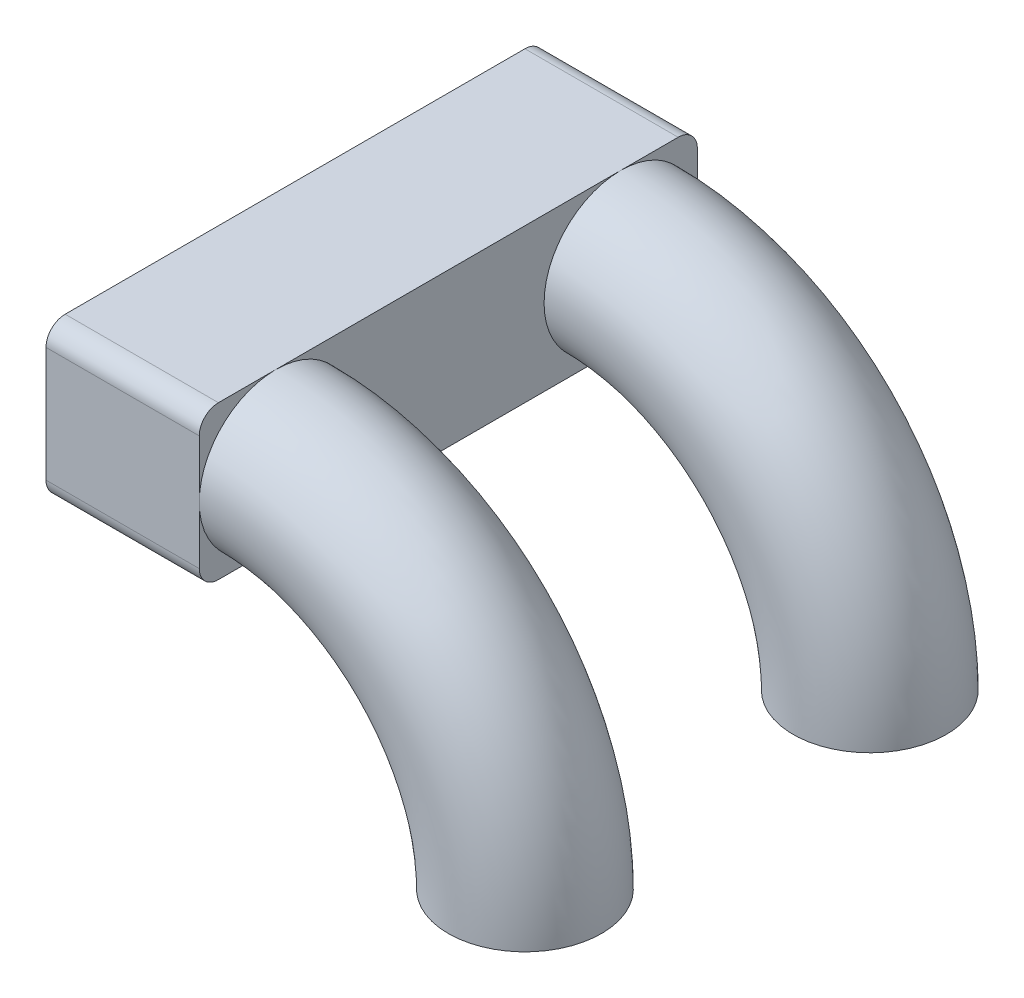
ISO-10303-21;
HEADER;
FILE_DESCRIPTION(('STEP AP214'),'2;1');
FILE_NAME('part.step','',(''),(''),'','','');
FILE_SCHEMA(('AUTOMOTIVE_DESIGN { 1 0 10303 214 1 1 1 1 }'));
ENDSEC;
DATA;
#1=APPLICATION_CONTEXT('core data for automotive mechanical design processes');
#2=APPLICATION_PROTOCOL_DEFINITION('international standard','automotive_design',2000,#1);
#3=PRODUCT_CONTEXT('',#1,'mechanical');
#4=PRODUCT('Part','Part','',(#3));
#5=PRODUCT_RELATED_PRODUCT_CATEGORY('part','',(#4));
#6=PRODUCT_DEFINITION_FORMATION('','',#4);
#7=PRODUCT_DEFINITION_CONTEXT('part definition',#1,'design');
#8=PRODUCT_DEFINITION('design','',#6,#7);
#9=PRODUCT_DEFINITION_SHAPE('','',#8);
#10=(LENGTH_UNIT() NAMED_UNIT(*) SI_UNIT(.MILLI.,.METRE.));
#11=(NAMED_UNIT(*) PLANE_ANGLE_UNIT() SI_UNIT($,.RADIAN.));
#12=(NAMED_UNIT(*) SI_UNIT($,.STERADIAN.) SOLID_ANGLE_UNIT());
#13=UNCERTAINTY_MEASURE_WITH_UNIT(LENGTH_MEASURE(1.E-05),#10,'distance_accuracy_value','');
#14=(GEOMETRIC_REPRESENTATION_CONTEXT(3) GLOBAL_UNCERTAINTY_ASSIGNED_CONTEXT((#13)) GLOBAL_UNIT_ASSIGNED_CONTEXT((#10,
#11,#12)) REPRESENTATION_CONTEXT('',''));
#15=CARTESIAN_POINT('',(0.,0.,0.));
#16=DIRECTION('',(0.,0.,1.));
#17=DIRECTION('',(1.,0.,0.));
#18=AXIS2_PLACEMENT_3D('',#15,#16,#17);
#19=CARTESIAN_POINT('',(18.,-20.,65.));
#20=DIRECTION('',(-1.,0.,0.));
#21=DIRECTION('',(0.,0.,1.));
#22=AXIS2_PLACEMENT_3D('',#19,#20,#21);
#23=PLANE('',#22);
#24=CARTESIAN_POINT('',(18.,0.,45.));
#25=DIRECTION('',(-1.,0.,0.));
#26=DIRECTION('',(0.,0.,1.));
#27=AXIS2_PLACEMENT_3D('',#24,#25,#26);
#28=CIRCLE('',#27,18.);
#29=CARTESIAN_POINT('',(18.,0.,63.));
#30=VERTEX_POINT('',#29);
#31=CARTESIAN_POINT('',(18.,18.,45.));
#32=VERTEX_POINT('',#31);
#33=EDGE_CURVE('E199',#30,#32,#28,.T.);
#34=ORIENTED_EDGE('',*,*,#33,.F.);
#35=DIRECTION('',(0.,1.,0.));
#36=VECTOR('',#35,1.);
#37=CARTESIAN_POINT('',(18.,0.,63.));
#38=LINE('',#37,#36);
#39=CARTESIAN_POINT('',(18.,15.,63.));
#40=VERTEX_POINT('',#39);
#41=EDGE_CURVE('E211',#30,#40,#38,.T.);
#42=ORIENTED_EDGE('',*,*,#41,.T.);
#43=CARTESIAN_POINT('',(18.,15.,60.));
#44=DIRECTION('',(-1.,0.,0.));
#45=DIRECTION('',(0.,0.,1.));
#46=AXIS2_PLACEMENT_3D('',#43,#44,#45);
#47=CIRCLE('',#46,3.);
#48=CARTESIAN_POINT('',(18.,18.,60.));
#49=VERTEX_POINT('',#48);
#50=EDGE_CURVE('E288',#49,#40,#47,.F.);
#51=ORIENTED_EDGE('',*,*,#50,.F.);
#52=DIRECTION('',(0.,0.,-1.));
#53=VECTOR('',#52,1.);
#54=CARTESIAN_POINT('',(18.,18.,65.));
#55=LINE('',#54,#53);
#56=EDGE_CURVE('E214',#49,#32,#55,.T.);
#57=ORIENTED_EDGE('',*,*,#56,.T.);
#58=EDGE_LOOP('',(#34,#42,#51,#57));
#59=FACE_BOUND('',#58,.T.);
#60=ADVANCED_FACE('F44',(#59),#23,.T.);
#61=CARTESIAN_POINT('',(18.,-18.,45.));
#62=VERTEX_POINT('',#61);
#63=EDGE_CURVE('E63',#32,#62,#28,.T.);
#64=ORIENTED_EDGE('',*,*,#63,.F.);
#65=CARTESIAN_POINT('',(18.,18.,-45.));
#66=VERTEX_POINT('',#65);
#67=EDGE_CURVE('E284',#32,#66,#55,.T.);
#68=ORIENTED_EDGE('',*,*,#67,.T.);
#69=CARTESIAN_POINT('',(18.,0.,-45.));
#70=DIRECTION('',(-1.,0.,0.));
#71=DIRECTION('',(0.,0.,1.));
#72=AXIS2_PLACEMENT_3D('',#69,#70,#71);
#73=CIRCLE('',#72,18.);
#74=CARTESIAN_POINT('',(18.,-18.,-45.));
#75=VERTEX_POINT('',#74);
#76=EDGE_CURVE('E386',#75,#66,#73,.T.);
#77=ORIENTED_EDGE('',*,*,#76,.F.);
#78=DIRECTION('',(0.,0.,-1.));
#79=VECTOR('',#78,1.);
#80=CARTESIAN_POINT('',(18.,-18.,65.));
#81=LINE('',#80,#79);
#82=EDGE_CURVE('E307',#62,#75,#81,.T.);
#83=ORIENTED_EDGE('',*,*,#82,.F.);
#84=EDGE_LOOP('',(#64,#68,#77,#83));
#85=FACE_BOUND('',#84,.T.);
#86=ADVANCED_FACE('F355',(#85),#23,.T.);
#87=CARTESIAN_POINT('',(20.,-20.,65.));
#88=DIRECTION('',(-1.,0.,0.));
#89=DIRECTION('',(0.,0.,1.));
#90=AXIS2_PLACEMENT_3D('',#87,#88,#89);
#91=PLANE('',#90);
#92=CARTESIAN_POINT('',(20.,0.,45.));
#93=DIRECTION('',(-1.,0.,0.));
#94=DIRECTION('',(0.,0.,1.));
#95=AXIS2_PLACEMENT_3D('',#92,#93,#94);
#96=CIRCLE('',#95,20.);
#97=CARTESIAN_POINT('',(20.,0.,65.));
#98=VERTEX_POINT('',#97);
#99=CARTESIAN_POINT('',(20.,-20.,45.));
#100=VERTEX_POINT('',#99);
#101=EDGE_CURVE('E835',#98,#100,#96,.F.);
#102=ORIENTED_EDGE('',*,*,#101,.F.);
#103=DIRECTION('',(0.,1.,0.));
#104=VECTOR('',#103,1.);
#105=CARTESIAN_POINT('',(20.,-20.,65.));
#106=LINE('',#105,#104);
#107=CARTESIAN_POINT('',(20.,-15.,65.));
#108=VERTEX_POINT('',#107);
#109=EDGE_CURVE('E751',#108,#98,#106,.T.);
#110=ORIENTED_EDGE('',*,*,#109,.F.);
#111=CARTESIAN_POINT('',(20.,-15.,60.));
#112=DIRECTION('',(-1.,0.,0.));
#113=DIRECTION('',(0.,0.,1.));
#114=AXIS2_PLACEMENT_3D('',#111,#112,#113);
#115=CIRCLE('',#114,5.);
#116=CARTESIAN_POINT('',(20.,-20.,60.));
#117=VERTEX_POINT('',#116);
#118=EDGE_CURVE('E797',#108,#117,#115,.F.);
#119=ORIENTED_EDGE('',*,*,#118,.T.);
#120=DIRECTION('',(0.,0.,-1.));
#121=VECTOR('',#120,1.);
#122=CARTESIAN_POINT('',(20.,-20.,65.));
#123=LINE('',#122,#121);
#124=EDGE_CURVE('E764',#117,#100,#123,.T.);
#125=ORIENTED_EDGE('',*,*,#124,.T.);
#126=EDGE_LOOP('',(#102,#110,#119,#125));
#127=FACE_BOUND('',#126,.T.);
#128=ADVANCED_FACE('F360',(#127),#91,.F.);
#129=CARTESIAN_POINT('',(20.,20.,45.));
#130=VERTEX_POINT('',#129);
#131=EDGE_CURVE('E71',#100,#130,#96,.F.);
#132=ORIENTED_EDGE('',*,*,#131,.F.);
#133=CARTESIAN_POINT('',(20.,-20.,-45.));
#134=VERTEX_POINT('',#133);
#135=EDGE_CURVE('E769',#100,#134,#123,.T.);
#136=ORIENTED_EDGE('',*,*,#135,.T.);
#137=CARTESIAN_POINT('',(20.,0.,-45.));
#138=DIRECTION('',(1.,0.,0.));
#139=DIRECTION('',(0.,0.,-1.));
#140=AXIS2_PLACEMENT_3D('',#137,#138,#139);
#141=CIRCLE('',#140,20.);
#142=CARTESIAN_POINT('',(20.,20.,-45.));
#143=VERTEX_POINT('',#142);
#144=EDGE_CURVE('E11',#143,#134,#141,.T.);
#145=ORIENTED_EDGE('',*,*,#144,.F.);
#146=DIRECTION('',(0.,0.,-1.));
#147=VECTOR('',#146,1.);
#148=CARTESIAN_POINT('',(20.,20.,65.));
#149=LINE('',#148,#147);
#150=EDGE_CURVE('E782',#130,#143,#149,.T.);
#151=ORIENTED_EDGE('',*,*,#150,.F.);
#152=EDGE_LOOP('',(#132,#136,#145,#151));
#153=FACE_BOUND('',#152,.T.);
#154=ADVANCED_FACE('F376',(#153),#91,.F.);
#155=CARTESIAN_POINT('',(18.,0.,-63.));
#156=VERTEX_POINT('',#155);
#157=EDGE_CURVE('E389',#66,#156,#73,.T.);
#158=ORIENTED_EDGE('',*,*,#157,.F.);
#159=CARTESIAN_POINT('',(18.,18.,-60.));
#160=VERTEX_POINT('',#159);
#161=EDGE_CURVE('E285',#66,#160,#55,.T.);
#162=ORIENTED_EDGE('',*,*,#161,.T.);
#163=CARTESIAN_POINT('',(18.,15.,-60.));
#164=DIRECTION('',(-1.,0.,0.));
#165=DIRECTION('',(0.,0.,1.));
#166=AXIS2_PLACEMENT_3D('',#163,#164,#165);
#167=CIRCLE('',#166,3.);
#168=CARTESIAN_POINT('',(18.,15.,-63.));
#169=VERTEX_POINT('',#168);
#170=EDGE_CURVE('E291',#169,#160,#167,.F.);
#171=ORIENTED_EDGE('',*,*,#170,.F.);
#172=DIRECTION('',(0.,1.,0.));
#173=VECTOR('',#172,1.);
#174=CARTESIAN_POINT('',(18.,0.,-63.));
#175=LINE('',#174,#173);
#176=EDGE_CURVE('E298',#156,#169,#175,.T.);
#177=ORIENTED_EDGE('',*,*,#176,.F.);
#178=EDGE_LOOP('',(#158,#162,#171,#177));
#179=FACE_BOUND('',#178,.T.);
#180=ADVANCED_FACE('F362',(#179),#23,.T.);
#181=EDGE_CURVE('E380',#156,#75,#73,.T.);
#182=ORIENTED_EDGE('',*,*,#181,.F.);
#183=CARTESIAN_POINT('',(18.,-15.,-63.));
#184=VERTEX_POINT('',#183);
#185=EDGE_CURVE('E295',#184,#156,#175,.T.);
#186=ORIENTED_EDGE('',*,*,#185,.F.);
#187=CARTESIAN_POINT('',(18.,-15.,-60.));
#188=DIRECTION('',(-1.,0.,0.));
#189=DIRECTION('',(0.,0.,1.));
#190=AXIS2_PLACEMENT_3D('',#187,#188,#189);
#191=CIRCLE('',#190,3.);
#192=CARTESIAN_POINT('',(18.,-18.,-60.));
#193=VERTEX_POINT('',#192);
#194=EDGE_CURVE('E299',#193,#184,#191,.F.);
#195=ORIENTED_EDGE('',*,*,#194,.F.);
#196=EDGE_CURVE('E308',#75,#193,#81,.T.);
#197=ORIENTED_EDGE('',*,*,#196,.F.);
#198=EDGE_LOOP('',(#182,#186,#195,#197));
#199=FACE_BOUND('',#198,.T.);
#200=ADVANCED_FACE('F366',(#199),#23,.T.);
#201=EDGE_CURVE('E195',#62,#30,#28,.T.);
#202=ORIENTED_EDGE('',*,*,#201,.F.);
#203=CARTESIAN_POINT('',(18.,-18.,60.));
#204=VERTEX_POINT('',#203);
#205=EDGE_CURVE('E48',#204,#62,#81,.T.);
#206=ORIENTED_EDGE('',*,*,#205,.F.);
#207=CARTESIAN_POINT('',(18.,-15.,60.));
#208=DIRECTION('',(-1.,0.,0.));
#209=DIRECTION('',(0.,0.,1.));
#210=AXIS2_PLACEMENT_3D('',#207,#208,#209);
#211=CIRCLE('',#210,3.);
#212=CARTESIAN_POINT('',(18.,-15.,63.));
#213=VERTEX_POINT('',#212);
#214=EDGE_CURVE('E230',#213,#204,#211,.F.);
#215=ORIENTED_EDGE('',*,*,#214,.F.);
#216=EDGE_CURVE('E222',#213,#30,#38,.T.);
#217=ORIENTED_EDGE('',*,*,#216,.T.);
#218=EDGE_LOOP('',(#202,#206,#215,#217));
#219=FACE_BOUND('',#218,.T.);
#220=ADVANCED_FACE('F229',(#219),#23,.T.);
#221=CARTESIAN_POINT('',(-20.,18.,65.));
#222=DIRECTION('',(0.,-1.,0.));
#223=DIRECTION('',(0.,0.,-1.));
#224=AXIS2_PLACEMENT_3D('',#221,#222,#223);
#225=PLANE('',#224);
#226=ORIENTED_EDGE('',*,*,#67,.F.);
#227=ORIENTED_EDGE('',*,*,#56,.F.);
#228=DIRECTION('',(1.,0.,0.));
#229=VECTOR('',#228,1.);
#230=CARTESIAN_POINT('',(-20.,18.,60.));
#231=LINE('',#230,#229);
#232=CARTESIAN_POINT('',(-18.,18.,60.));
#233=VERTEX_POINT('',#232);
#234=EDGE_CURVE('E275',#233,#49,#231,.T.);
#235=ORIENTED_EDGE('',*,*,#234,.F.);
#236=DIRECTION('',(0.,0.,-1.));
#237=VECTOR('',#236,1.);
#238=CARTESIAN_POINT('',(-18.,18.,65.));
#239=LINE('',#238,#237);
#240=CARTESIAN_POINT('',(-18.,18.,-60.));
#241=VERTEX_POINT('',#240);
#242=EDGE_CURVE('E258',#233,#241,#239,.T.);
#243=ORIENTED_EDGE('',*,*,#242,.T.);
#244=DIRECTION('',(1.,0.,0.));
#245=VECTOR('',#244,1.);
#246=CARTESIAN_POINT('',(-20.,18.,-60.));
#247=LINE('',#246,#245);
#248=EDGE_CURVE('E278',#160,#241,#247,.F.);
#249=ORIENTED_EDGE('',*,*,#248,.F.);
#250=ORIENTED_EDGE('',*,*,#161,.F.);
#251=EDGE_LOOP('',(#226,#227,#235,#243,#249,#250));
#252=FACE_BOUND('',#251,.T.);
#253=ADVANCED_FACE('F352',(#252),#225,.T.);
#254=CARTESIAN_POINT('',(-18.,-20.,65.));
#255=DIRECTION('',(1.,0.,0.));
#256=DIRECTION('',(0.,0.,-1.));
#257=AXIS2_PLACEMENT_3D('',#254,#255,#256);
#258=PLANE('',#257);
#259=DIRECTION('',(0.,-1.,0.));
#260=VECTOR('',#259,1.);
#261=CARTESIAN_POINT('',(-18.,0.,-63.));
#262=LINE('',#261,#260);
#263=CARTESIAN_POINT('',(-18.,15.,-63.));
#264=VERTEX_POINT('',#263);
#265=CARTESIAN_POINT('',(-18.,-15.,-63.));
#266=VERTEX_POINT('',#265);
#267=EDGE_CURVE('E271',#264,#266,#262,.T.);
#268=ORIENTED_EDGE('',*,*,#267,.F.);
#269=CARTESIAN_POINT('',(-18.,15.,-60.));
#270=DIRECTION('',(1.,0.,0.));
#271=DIRECTION('',(0.,0.,-1.));
#272=AXIS2_PLACEMENT_3D('',#269,#270,#271);
#273=CIRCLE('',#272,3.);
#274=EDGE_CURVE('E255',#241,#264,#273,.F.);
#275=ORIENTED_EDGE('',*,*,#274,.F.);
#276=ORIENTED_EDGE('',*,*,#242,.F.);
#277=CARTESIAN_POINT('',(-18.,15.,60.));
#278=DIRECTION('',(1.,0.,0.));
#279=DIRECTION('',(0.,0.,-1.));
#280=AXIS2_PLACEMENT_3D('',#277,#278,#279);
#281=CIRCLE('',#280,3.);
#282=CARTESIAN_POINT('',(-18.,15.,63.));
#283=VERTEX_POINT('',#282);
#284=EDGE_CURVE('E262',#283,#233,#281,.F.);
#285=ORIENTED_EDGE('',*,*,#284,.F.);
#286=DIRECTION('',(0.,-1.,0.));
#287=VECTOR('',#286,1.);
#288=CARTESIAN_POINT('',(-18.,0.,63.));
#289=LINE('',#288,#287);
#290=CARTESIAN_POINT('',(-18.,-15.,63.));
#291=VERTEX_POINT('',#290);
#292=EDGE_CURVE('E240',#283,#291,#289,.T.);
#293=ORIENTED_EDGE('',*,*,#292,.T.);
#294=CARTESIAN_POINT('',(-18.,-15.,60.));
#295=DIRECTION('',(1.,0.,0.));
#296=DIRECTION('',(0.,0.,-1.));
#297=AXIS2_PLACEMENT_3D('',#294,#295,#296);
#298=CIRCLE('',#297,3.);
#299=CARTESIAN_POINT('',(-18.,-18.,60.));
#300=VERTEX_POINT('',#299);
#301=EDGE_CURVE('E265',#300,#291,#298,.F.);
#302=ORIENTED_EDGE('',*,*,#301,.F.);
#303=DIRECTION('',(0.,0.,-1.));
#304=VECTOR('',#303,1.);
#305=CARTESIAN_POINT('',(-18.,-18.,65.));
#306=LINE('',#305,#304);
#307=CARTESIAN_POINT('',(-18.,-18.,-60.));
#308=VERTEX_POINT('',#307);
#309=EDGE_CURVE('E251',#300,#308,#306,.T.);
#310=ORIENTED_EDGE('',*,*,#309,.T.);
#311=CARTESIAN_POINT('',(-18.,-15.,-60.));
#312=DIRECTION('',(1.,0.,0.));
#313=DIRECTION('',(0.,0.,-1.));
#314=AXIS2_PLACEMENT_3D('',#311,#312,#313);
#315=CIRCLE('',#314,3.);
#316=EDGE_CURVE('E268',#266,#308,#315,.F.);
#317=ORIENTED_EDGE('',*,*,#316,.F.);
#318=EDGE_LOOP('',(#268,#275,#276,#285,#293,#302,#310,#317));
#319=FACE_BOUND('',#318,.T.);
#320=ADVANCED_FACE('F341',(#319),#258,.T.);
#321=CARTESIAN_POINT('',(-20.,-18.,65.));
#322=DIRECTION('',(0.,1.,0.));
#323=DIRECTION('',(0.,0.,1.));
#324=AXIS2_PLACEMENT_3D('',#321,#322,#323);
#325=PLANE('',#324);
#326=ORIENTED_EDGE('',*,*,#205,.T.);
#327=ORIENTED_EDGE('',*,*,#82,.T.);
#328=ORIENTED_EDGE('',*,*,#196,.T.);
#329=DIRECTION('',(1.,0.,0.));
#330=VECTOR('',#329,1.);
#331=CARTESIAN_POINT('',(-20.,-18.,-60.));
#332=LINE('',#331,#330);
#333=EDGE_CURVE('E247',#308,#193,#332,.T.);
#334=ORIENTED_EDGE('',*,*,#333,.F.);
#335=ORIENTED_EDGE('',*,*,#309,.F.);
#336=DIRECTION('',(1.,0.,0.));
#337=VECTOR('',#336,1.);
#338=CARTESIAN_POINT('',(-20.,-18.,60.));
#339=LINE('',#338,#337);
#340=EDGE_CURVE('E244',#204,#300,#339,.F.);
#341=ORIENTED_EDGE('',*,*,#340,.F.);
#342=EDGE_LOOP('',(#326,#327,#328,#334,#335,#341));
#343=FACE_BOUND('',#342,.T.);
#344=ADVANCED_FACE('F344',(#343),#325,.T.);
#345=CARTESIAN_POINT('',(0.,0.,63.));
#346=DIRECTION('',(0.,0.,-1.));
#347=DIRECTION('',(-1.,0.,0.));
#348=AXIS2_PLACEMENT_3D('',#345,#346,#347);
#349=PLANE('',#348);
#350=ORIENTED_EDGE('',*,*,#41,.F.);
#351=ORIENTED_EDGE('',*,*,#216,.F.);
#352=DIRECTION('',(-1.,0.,0.));
#353=VECTOR('',#352,1.);
#354=CARTESIAN_POINT('',(0.,-15.,63.));
#355=LINE('',#354,#353);
#356=EDGE_CURVE('E227',#291,#213,#355,.F.);
#357=ORIENTED_EDGE('',*,*,#356,.F.);
#358=ORIENTED_EDGE('',*,*,#292,.F.);
#359=DIRECTION('',(-1.,0.,0.));
#360=VECTOR('',#359,1.);
#361=CARTESIAN_POINT('',(0.,15.,63.));
#362=LINE('',#361,#360);
#363=EDGE_CURVE('E225',#40,#283,#362,.T.);
#364=ORIENTED_EDGE('',*,*,#363,.F.);
#365=EDGE_LOOP('',(#350,#351,#357,#358,#364));
#366=FACE_BOUND('',#365,.T.);
#367=ADVANCED_FACE('F220',(#366),#349,.T.);
#368=CARTESIAN_POINT('',(0.,0.,-63.));
#369=DIRECTION('',(0.,0.,-1.));
#370=DIRECTION('',(-1.,0.,0.));
#371=AXIS2_PLACEMENT_3D('',#368,#369,#370);
#372=PLANE('',#371);
#373=ORIENTED_EDGE('',*,*,#185,.T.);
#374=ORIENTED_EDGE('',*,*,#176,.T.);
#375=DIRECTION('',(-1.,0.,0.));
#376=VECTOR('',#375,1.);
#377=CARTESIAN_POINT('',(0.,15.,-63.));
#378=LINE('',#377,#376);
#379=EDGE_CURVE('E329',#264,#169,#378,.F.);
#380=ORIENTED_EDGE('',*,*,#379,.F.);
#381=ORIENTED_EDGE('',*,*,#267,.T.);
#382=DIRECTION('',(-1.,0.,0.));
#383=VECTOR('',#382,1.);
#384=CARTESIAN_POINT('',(0.,-15.,-63.));
#385=LINE('',#384,#383);
#386=EDGE_CURVE('E234',#184,#266,#385,.T.);
#387=ORIENTED_EDGE('',*,*,#386,.F.);
#388=EDGE_LOOP('',(#373,#374,#380,#381,#387));
#389=FACE_BOUND('',#388,.T.);
#390=ADVANCED_FACE('F339',(#389),#372,.F.);
#391=CARTESIAN_POINT('',(-20.,-15.,-60.));
#392=DIRECTION('',(-1.,0.,0.));
#393=DIRECTION('',(0.,0.,1.));
#394=AXIS2_PLACEMENT_3D('',#391,#392,#393);
#395=CYLINDRICAL_SURFACE('',#394,3.);
#396=ORIENTED_EDGE('',*,*,#316,.T.);
#397=ORIENTED_EDGE('',*,*,#333,.T.);
#398=ORIENTED_EDGE('',*,*,#194,.T.);
#399=ORIENTED_EDGE('',*,*,#386,.T.);
#400=EDGE_LOOP('',(#396,#397,#398,#399));
#401=FACE_BOUND('',#400,.T.);
#402=ADVANCED_FACE('F334',(#401),#395,.F.);
#403=CARTESIAN_POINT('',(0.,-15.,60.));
#404=DIRECTION('',(1.,0.,0.));
#405=DIRECTION('',(0.,0.,-1.));
#406=AXIS2_PLACEMENT_3D('',#403,#404,#405);
#407=CYLINDRICAL_SURFACE('',#406,3.);
#408=ORIENTED_EDGE('',*,*,#301,.T.);
#409=ORIENTED_EDGE('',*,*,#356,.T.);
#410=ORIENTED_EDGE('',*,*,#214,.T.);
#411=ORIENTED_EDGE('',*,*,#340,.T.);
#412=EDGE_LOOP('',(#408,#409,#410,#411));
#413=FACE_BOUND('',#412,.T.);
#414=ADVANCED_FACE('F401',(#413),#407,.F.);
#415=CARTESIAN_POINT('',(-20.,15.,-60.));
#416=DIRECTION('',(1.,0.,0.));
#417=DIRECTION('',(0.,0.,-1.));
#418=AXIS2_PLACEMENT_3D('',#415,#416,#417);
#419=CYLINDRICAL_SURFACE('',#418,3.);
#420=ORIENTED_EDGE('',*,*,#170,.T.);
#421=ORIENTED_EDGE('',*,*,#248,.T.);
#422=ORIENTED_EDGE('',*,*,#274,.T.);
#423=ORIENTED_EDGE('',*,*,#379,.T.);
#424=EDGE_LOOP('',(#420,#421,#422,#423));
#425=FACE_BOUND('',#424,.T.);
#426=ADVANCED_FACE('F394',(#425),#419,.F.);
#427=CARTESIAN_POINT('',(0.,15.,60.));
#428=DIRECTION('',(-1.,0.,0.));
#429=DIRECTION('',(0.,0.,1.));
#430=AXIS2_PLACEMENT_3D('',#427,#428,#429);
#431=CYLINDRICAL_SURFACE('',#430,3.);
#432=ORIENTED_EDGE('',*,*,#50,.T.);
#433=ORIENTED_EDGE('',*,*,#363,.T.);
#434=ORIENTED_EDGE('',*,*,#284,.T.);
#435=ORIENTED_EDGE('',*,*,#234,.T.);
#436=EDGE_LOOP('',(#432,#433,#434,#435));
#437=FACE_BOUND('',#436,.T.);
#438=ADVANCED_FACE('F46',(#437),#431,.F.);
#439=CARTESIAN_POINT('',(0.11085381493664,0.,-45.));
#440=DIRECTION('',(1.,0.,0.));
#441=DIRECTION('',(0.,0.,-1.));
#442=AXIS2_PLACEMENT_3D('',#439,#440,#441);
#443=CYLINDRICAL_SURFACE('',#442,18.);
#444=ORIENTED_EDGE('',*,*,#157,.T.);
#445=ORIENTED_EDGE('',*,*,#181,.T.);
#446=ORIENTED_EDGE('',*,*,#76,.T.);
#447=EDGE_LOOP('',(#444,#445,#446));
#448=FACE_BOUND('',#447,.T.);
#449=CARTESIAN_POINT('',(20.,0.,-45.));
#450=DIRECTION('',(1.,0.,0.));
#451=DIRECTION('',(0.,1.,0.));
#452=AXIS2_PLACEMENT_3D('',#449,#450,#451);
#453=CIRCLE('',#452,18.);
#454=CARTESIAN_POINT('',(20.,18.,-45.));
#455=VERTEX_POINT('',#454);
#456=EDGE_CURVE('E849',#455,#455,#453,.T.);
#457=ORIENTED_EDGE('',*,*,#456,.T.);
#458=EDGE_LOOP('',(#457));
#459=FACE_BOUND('',#458,.T.);
#460=ADVANCED_FACE('F446',(#448,#459),#443,.F.);
#461=CARTESIAN_POINT('',(20.,-65.,-45.));
#462=DIRECTION('',(0.,0.,-1.));
#463=DIRECTION('',(-1.,0.,0.));
#464=AXIS2_PLACEMENT_3D('',#461,#462,#463);
#465=TOROIDAL_SURFACE('',#464,65.,18.);
#466=CARTESIAN_POINT('',(85.,-65.,-45.));
#467=DIRECTION('',(0.,-1.,0.));
#468=DIRECTION('',(1.,0.,0.));
#469=AXIS2_PLACEMENT_3D('',#466,#467,#468);
#470=CIRCLE('',#469,18.);
#471=CARTESIAN_POINT('',(103.,-65.,-45.));
#472=VERTEX_POINT('',#471);
#473=EDGE_CURVE('E387',#472,#472,#470,.T.);
#474=CARTESIAN_POINT('',(20.,-65.,-45.));
#475=DIRECTION('',(0.,0.,-1.));
#476=DIRECTION('',(-1.,0.,0.));
#477=AXIS2_PLACEMENT_3D('',#474,#475,#476);
#478=CIRCLE('',#477,83.);
#479=EDGE_CURVE('',#455,#472,#478,.T.);
#480=ORIENTED_EDGE('',*,*,#456,.F.);
#481=ORIENTED_EDGE('',*,*,#473,.T.);
#482=ORIENTED_EDGE('',*,*,#479,.T.);
#483=ORIENTED_EDGE('',*,*,#479,.F.);
#484=EDGE_LOOP('',(#480,#482,#481,#483));
#485=FACE_BOUND('',#484,.T.);
#486=ADVANCED_FACE('F459',(#485),#465,.F.);
#487=CARTESIAN_POINT('',(20.,0.,-65.));
#488=VERTEX_POINT('',#487);
#489=EDGE_CURVE('E56',#488,#143,#141,.T.);
#490=ORIENTED_EDGE('',*,*,#489,.F.);
#491=DIRECTION('',(0.,1.,0.));
#492=VECTOR('',#491,1.);
#493=CARTESIAN_POINT('',(20.,-20.,-65.));
#494=LINE('',#493,#492);
#495=CARTESIAN_POINT('',(20.,15.,-65.));
#496=VERTEX_POINT('',#495);
#497=EDGE_CURVE('E743',#488,#496,#494,.T.);
#498=ORIENTED_EDGE('',*,*,#497,.T.);
#499=CARTESIAN_POINT('',(20.,15.,-60.));
#500=DIRECTION('',(-1.,0.,0.));
#501=DIRECTION('',(0.,0.,1.));
#502=AXIS2_PLACEMENT_3D('',#499,#500,#501);
#503=CIRCLE('',#502,5.);
#504=CARTESIAN_POINT('',(20.,20.,-60.));
#505=VERTEX_POINT('',#504);
#506=EDGE_CURVE('E793',#496,#505,#503,.F.);
#507=ORIENTED_EDGE('',*,*,#506,.T.);
#508=EDGE_CURVE('E776',#143,#505,#149,.T.);
#509=ORIENTED_EDGE('',*,*,#508,.F.);
#510=EDGE_LOOP('',(#490,#498,#507,#509));
#511=FACE_BOUND('',#510,.T.);
#512=ADVANCED_FACE('F453',(#511),#91,.F.);
#513=EDGE_CURVE('E216',#130,#98,#96,.F.);
#514=ORIENTED_EDGE('',*,*,#513,.F.);
#515=CARTESIAN_POINT('',(20.,20.,60.));
#516=VERTEX_POINT('',#515);
#517=EDGE_CURVE('E777',#516,#130,#149,.T.);
#518=ORIENTED_EDGE('',*,*,#517,.F.);
#519=CARTESIAN_POINT('',(20.,15.,60.));
#520=DIRECTION('',(-1.,0.,0.));
#521=DIRECTION('',(0.,0.,1.));
#522=AXIS2_PLACEMENT_3D('',#519,#520,#521);
#523=CIRCLE('',#522,5.);
#524=CARTESIAN_POINT('',(20.,15.,65.));
#525=VERTEX_POINT('',#524);
#526=EDGE_CURVE('E789',#516,#525,#523,.F.);
#527=ORIENTED_EDGE('',*,*,#526,.T.);
#528=EDGE_CURVE('E755',#98,#525,#106,.T.);
#529=ORIENTED_EDGE('',*,*,#528,.F.);
#530=EDGE_LOOP('',(#514,#518,#527,#529));
#531=FACE_BOUND('',#530,.T.);
#532=ADVANCED_FACE('F458',(#531),#91,.F.);
#533=EDGE_CURVE('E54',#134,#488,#141,.T.);
#534=ORIENTED_EDGE('',*,*,#533,.F.);
#535=CARTESIAN_POINT('',(20.,-20.,-60.));
#536=VERTEX_POINT('',#535);
#537=EDGE_CURVE('E758',#134,#536,#123,.T.);
#538=ORIENTED_EDGE('',*,*,#537,.T.);
#539=CARTESIAN_POINT('',(20.,-15.,-60.));
#540=DIRECTION('',(-1.,0.,0.));
#541=DIRECTION('',(0.,0.,1.));
#542=AXIS2_PLACEMENT_3D('',#539,#540,#541);
#543=CIRCLE('',#542,5.);
#544=CARTESIAN_POINT('',(20.,-15.,-65.));
#545=VERTEX_POINT('',#544);
#546=EDGE_CURVE('E800',#536,#545,#543,.F.);
#547=ORIENTED_EDGE('',*,*,#546,.T.);
#548=EDGE_CURVE('E747',#545,#488,#494,.T.);
#549=ORIENTED_EDGE('',*,*,#548,.T.);
#550=EDGE_LOOP('',(#534,#538,#547,#549));
#551=FACE_BOUND('',#550,.T.);
#552=ADVANCED_FACE('F469',(#551),#91,.F.);
#553=CARTESIAN_POINT('',(-20.,20.,65.));
#554=DIRECTION('',(0.,-1.,0.));
#555=DIRECTION('',(0.,0.,-1.));
#556=AXIS2_PLACEMENT_3D('',#553,#554,#555);
#557=PLANE('',#556);
#558=ORIENTED_EDGE('',*,*,#517,.T.);
#559=ORIENTED_EDGE('',*,*,#150,.T.);
#560=ORIENTED_EDGE('',*,*,#508,.T.);
#561=DIRECTION('',(-1.,0.,0.));
#562=VECTOR('',#561,1.);
#563=CARTESIAN_POINT('',(-20.,20.,-60.));
#564=LINE('',#563,#562);
#565=CARTESIAN_POINT('',(-20.,20.,-60.));
#566=VERTEX_POINT('',#565);
#567=EDGE_CURVE('E313',#505,#566,#564,.T.);
#568=ORIENTED_EDGE('',*,*,#567,.T.);
#569=DIRECTION('',(0.,0.,-1.));
#570=VECTOR('',#569,1.);
#571=CARTESIAN_POINT('',(-20.,20.,65.));
#572=LINE('',#571,#570);
#573=CARTESIAN_POINT('',(-20.,20.,60.));
#574=VERTEX_POINT('',#573);
#575=EDGE_CURVE('E773',#574,#566,#572,.T.);
#576=ORIENTED_EDGE('',*,*,#575,.F.);
#577=DIRECTION('',(-1.,0.,0.));
#578=VECTOR('',#577,1.);
#579=CARTESIAN_POINT('',(-20.,20.,60.));
#580=LINE('',#579,#578);
#581=EDGE_CURVE('E318',#574,#516,#580,.F.);
#582=ORIENTED_EDGE('',*,*,#581,.T.);
#583=EDGE_LOOP('',(#558,#559,#560,#568,#576,#582));
#584=FACE_BOUND('',#583,.T.);
#585=ADVANCED_FACE('F474',(#584),#557,.F.);
#586=CARTESIAN_POINT('',(-20.,-20.,65.));
#587=DIRECTION('',(1.,0.,0.));
#588=DIRECTION('',(0.,0.,-1.));
#589=AXIS2_PLACEMENT_3D('',#586,#587,#588);
#590=PLANE('',#589);
#591=DIRECTION('',(0.,-1.,0.));
#592=VECTOR('',#591,1.);
#593=CARTESIAN_POINT('',(-20.,-20.,-65.));
#594=LINE('',#593,#592);
#595=CARTESIAN_POINT('',(-20.,15.,-65.));
#596=VERTEX_POINT('',#595);
#597=CARTESIAN_POINT('',(-20.,-15.,-65.));
#598=VERTEX_POINT('',#597);
#599=EDGE_CURVE('E761',#596,#598,#594,.T.);
#600=ORIENTED_EDGE('',*,*,#599,.T.);
#601=CARTESIAN_POINT('',(-20.,-15.,-60.));
#602=DIRECTION('',(1.,0.,0.));
#603=DIRECTION('',(0.,0.,-1.));
#604=AXIS2_PLACEMENT_3D('',#601,#602,#603);
#605=CIRCLE('',#604,5.);
#606=CARTESIAN_POINT('',(-20.,-20.,-60.));
#607=VERTEX_POINT('',#606);
#608=EDGE_CURVE('E819',#598,#607,#605,.F.);
#609=ORIENTED_EDGE('',*,*,#608,.T.);
#610=DIRECTION('',(0.,0.,-1.));
#611=VECTOR('',#610,1.);
#612=CARTESIAN_POINT('',(-20.,-20.,65.));
#613=LINE('',#612,#611);
#614=CARTESIAN_POINT('',(-20.,-20.,60.));
#615=VERTEX_POINT('',#614);
#616=EDGE_CURVE('E768',#615,#607,#613,.T.);
#617=ORIENTED_EDGE('',*,*,#616,.F.);
#618=CARTESIAN_POINT('',(-20.,-15.,60.));
#619=DIRECTION('',(1.,0.,0.));
#620=DIRECTION('',(0.,0.,-1.));
#621=AXIS2_PLACEMENT_3D('',#618,#619,#620);
#622=CIRCLE('',#621,5.);
#623=CARTESIAN_POINT('',(-20.,-15.,65.));
#624=VERTEX_POINT('',#623);
#625=EDGE_CURVE('E816',#615,#624,#622,.F.);
#626=ORIENTED_EDGE('',*,*,#625,.T.);
#627=DIRECTION('',(0.,-1.,0.));
#628=VECTOR('',#627,1.);
#629=CARTESIAN_POINT('',(-20.,-20.,65.));
#630=LINE('',#629,#628);
#631=CARTESIAN_POINT('',(-20.,15.,65.));
#632=VERTEX_POINT('',#631);
#633=EDGE_CURVE('E754',#632,#624,#630,.T.);
#634=ORIENTED_EDGE('',*,*,#633,.F.);
#635=CARTESIAN_POINT('',(-20.,15.,60.));
#636=DIRECTION('',(1.,0.,0.));
#637=DIRECTION('',(0.,0.,-1.));
#638=AXIS2_PLACEMENT_3D('',#635,#636,#637);
#639=CIRCLE('',#638,5.);
#640=EDGE_CURVE('E810',#632,#574,#639,.F.);
#641=ORIENTED_EDGE('',*,*,#640,.T.);
#642=ORIENTED_EDGE('',*,*,#575,.T.);
#643=CARTESIAN_POINT('',(-20.,15.,-60.));
#644=DIRECTION('',(1.,0.,0.));
#645=DIRECTION('',(0.,0.,-1.));
#646=AXIS2_PLACEMENT_3D('',#643,#644,#645);
#647=CIRCLE('',#646,5.);
#648=EDGE_CURVE('E813',#566,#596,#647,.F.);
#649=ORIENTED_EDGE('',*,*,#648,.T.);
#650=EDGE_LOOP('',(#600,#609,#617,#626,#634,#641,#642,#649));
#651=FACE_BOUND('',#650,.T.);
#652=ADVANCED_FACE('F630',(#651),#590,.F.);
#653=CARTESIAN_POINT('',(-20.,-20.,65.));
#654=DIRECTION('',(0.,1.,0.));
#655=DIRECTION('',(0.,0.,1.));
#656=AXIS2_PLACEMENT_3D('',#653,#654,#655);
#657=PLANE('',#656);
#658=ORIENTED_EDGE('',*,*,#616,.T.);
#659=DIRECTION('',(1.,0.,0.));
#660=VECTOR('',#659,1.);
#661=CARTESIAN_POINT('',(20.,-20.,-60.));
#662=LINE('',#661,#660);
#663=EDGE_CURVE('E785',#607,#536,#662,.T.);
#664=ORIENTED_EDGE('',*,*,#663,.T.);
#665=ORIENTED_EDGE('',*,*,#537,.F.);
#666=ORIENTED_EDGE('',*,*,#135,.F.);
#667=ORIENTED_EDGE('',*,*,#124,.F.);
#668=DIRECTION('',(1.,0.,0.));
#669=VECTOR('',#668,1.);
#670=CARTESIAN_POINT('',(-20.,-20.,60.));
#671=LINE('',#670,#669);
#672=EDGE_CURVE('E781',#117,#615,#671,.F.);
#673=ORIENTED_EDGE('',*,*,#672,.T.);
#674=EDGE_LOOP('',(#658,#664,#665,#666,#667,#673));
#675=FACE_BOUND('',#674,.T.);
#676=ADVANCED_FACE('F619',(#675),#657,.F.);
#677=CARTESIAN_POINT('',(0.,0.,65.));
#678=DIRECTION('',(0.,0.,-1.));
#679=DIRECTION('',(-1.,0.,0.));
#680=AXIS2_PLACEMENT_3D('',#677,#678,#679);
#681=PLANE('',#680);
#682=ORIENTED_EDGE('',*,*,#633,.T.);
#683=DIRECTION('',(1.,0.,0.));
#684=VECTOR('',#683,1.);
#685=CARTESIAN_POINT('',(0.,-15.,65.));
#686=LINE('',#685,#684);
#687=EDGE_CURVE('E325',#624,#108,#686,.T.);
#688=ORIENTED_EDGE('',*,*,#687,.T.);
#689=ORIENTED_EDGE('',*,*,#109,.T.);
#690=ORIENTED_EDGE('',*,*,#528,.T.);
#691=DIRECTION('',(-1.,0.,0.));
#692=VECTOR('',#691,1.);
#693=CARTESIAN_POINT('',(0.,15.,65.));
#694=LINE('',#693,#692);
#695=EDGE_CURVE('E822',#525,#632,#694,.T.);
#696=ORIENTED_EDGE('',*,*,#695,.T.);
#697=EDGE_LOOP('',(#682,#688,#689,#690,#696));
#698=FACE_BOUND('',#697,.T.);
#699=ADVANCED_FACE('F488',(#698),#681,.F.);
#700=CARTESIAN_POINT('',(0.,0.,-65.));
#701=DIRECTION('',(0.,0.,-1.));
#702=DIRECTION('',(-1.,0.,0.));
#703=AXIS2_PLACEMENT_3D('',#700,#701,#702);
#704=PLANE('',#703);
#705=ORIENTED_EDGE('',*,*,#548,.F.);
#706=DIRECTION('',(1.,0.,0.));
#707=VECTOR('',#706,1.);
#708=CARTESIAN_POINT('',(-20.,-15.,-65.));
#709=LINE('',#708,#707);
#710=EDGE_CURVE('E807',#545,#598,#709,.F.);
#711=ORIENTED_EDGE('',*,*,#710,.T.);
#712=ORIENTED_EDGE('',*,*,#599,.F.);
#713=DIRECTION('',(-1.,0.,0.));
#714=VECTOR('',#713,1.);
#715=CARTESIAN_POINT('',(20.,15.,-65.));
#716=LINE('',#715,#714);
#717=EDGE_CURVE('E803',#596,#496,#716,.F.);
#718=ORIENTED_EDGE('',*,*,#717,.T.);
#719=ORIENTED_EDGE('',*,*,#497,.F.);
#720=EDGE_LOOP('',(#705,#711,#712,#718,#719));
#721=FACE_BOUND('',#720,.T.);
#722=ADVANCED_FACE('F482',(#721),#704,.T.);
#723=CARTESIAN_POINT('',(-20.,-15.,-60.));
#724=DIRECTION('',(-1.,0.,0.));
#725=DIRECTION('',(0.,0.,1.));
#726=AXIS2_PLACEMENT_3D('',#723,#724,#725);
#727=CYLINDRICAL_SURFACE('',#726,5.);
#728=ORIENTED_EDGE('',*,*,#608,.F.);
#729=ORIENTED_EDGE('',*,*,#710,.F.);
#730=ORIENTED_EDGE('',*,*,#546,.F.);
#731=ORIENTED_EDGE('',*,*,#663,.F.);
#732=EDGE_LOOP('',(#728,#729,#730,#731));
#733=FACE_BOUND('',#732,.T.);
#734=ADVANCED_FACE('F487',(#733),#727,.T.);
#735=CARTESIAN_POINT('',(0.,-15.,60.));
#736=DIRECTION('',(1.,0.,0.));
#737=DIRECTION('',(0.,0.,-1.));
#738=AXIS2_PLACEMENT_3D('',#735,#736,#737);
#739=CYLINDRICAL_SURFACE('',#738,5.);
#740=ORIENTED_EDGE('',*,*,#625,.F.);
#741=ORIENTED_EDGE('',*,*,#672,.F.);
#742=ORIENTED_EDGE('',*,*,#118,.F.);
#743=ORIENTED_EDGE('',*,*,#687,.F.);
#744=EDGE_LOOP('',(#740,#741,#742,#743));
#745=FACE_BOUND('',#744,.T.);
#746=ADVANCED_FACE('F694',(#745),#739,.T.);
#747=CARTESIAN_POINT('',(-20.,15.,-60.));
#748=DIRECTION('',(1.,0.,0.));
#749=DIRECTION('',(0.,0.,-1.));
#750=AXIS2_PLACEMENT_3D('',#747,#748,#749);
#751=CYLINDRICAL_SURFACE('',#750,5.);
#752=ORIENTED_EDGE('',*,*,#506,.F.);
#753=ORIENTED_EDGE('',*,*,#717,.F.);
#754=ORIENTED_EDGE('',*,*,#648,.F.);
#755=ORIENTED_EDGE('',*,*,#567,.F.);
#756=EDGE_LOOP('',(#752,#753,#754,#755));
#757=FACE_BOUND('',#756,.T.);
#758=ADVANCED_FACE('F684',(#757),#751,.T.);
#759=CARTESIAN_POINT('',(0.,15.,60.));
#760=DIRECTION('',(-1.,0.,0.));
#761=DIRECTION('',(0.,0.,1.));
#762=AXIS2_PLACEMENT_3D('',#759,#760,#761);
#763=CYLINDRICAL_SURFACE('',#762,5.);
#764=ORIENTED_EDGE('',*,*,#526,.F.);
#765=ORIENTED_EDGE('',*,*,#581,.F.);
#766=ORIENTED_EDGE('',*,*,#640,.F.);
#767=ORIENTED_EDGE('',*,*,#695,.F.);
#768=EDGE_LOOP('',(#764,#765,#766,#767));
#769=FACE_BOUND('',#768,.T.);
#770=ADVANCED_FACE('F508',(#769),#763,.T.);
#771=CARTESIAN_POINT('',(85.,-65.,-45.));
#772=DIRECTION('',(0.,-1.,0.));
#773=DIRECTION('',(0.,0.,-1.));
#774=AXIS2_PLACEMENT_3D('',#771,#772,#773);
#775=PLANE('',#774);
#776=ORIENTED_EDGE('',*,*,#473,.F.);
#777=EDGE_LOOP('',(#776));
#778=FACE_BOUND('',#777,.T.);
#779=CARTESIAN_POINT('',(85.,-65.,-45.));
#780=DIRECTION('',(0.,-1.,0.));
#781=DIRECTION('',(0.,0.,-1.));
#782=AXIS2_PLACEMENT_3D('',#779,#780,#781);
#783=CIRCLE('',#782,20.);
#784=CARTESIAN_POINT('',(85.,-65.,-65.));
#785=VERTEX_POINT('',#784);
#786=EDGE_CURVE('E741',#785,#785,#783,.T.);
#787=ORIENTED_EDGE('',*,*,#786,.T.);
#788=EDGE_LOOP('',(#787));
#789=FACE_BOUND('',#788,.T.);
#790=ADVANCED_FACE('F505',(#778,#789),#775,.T.);
#791=CARTESIAN_POINT('',(20.,-65.,-45.));
#792=DIRECTION('',(0.,0.,-1.));
#793=DIRECTION('',(-1.,0.,0.));
#794=AXIS2_PLACEMENT_3D('',#791,#792,#793);
#795=TOROIDAL_SURFACE('',#794,65.,20.);
#796=ORIENTED_EDGE('',*,*,#786,.F.);
#797=EDGE_LOOP('',(#796));
#798=FACE_BOUND('',#797,.T.);
#799=ORIENTED_EDGE('',*,*,#489,.T.);
#800=ORIENTED_EDGE('',*,*,#144,.T.);
#801=ORIENTED_EDGE('',*,*,#533,.T.);
#802=EDGE_LOOP('',(#799,#800,#801));
#803=FACE_BOUND('',#802,.T.);
#804=ADVANCED_FACE('F499',(#798,#803),#795,.T.);
#805=CARTESIAN_POINT('',(85.,-65.,45.));
#806=DIRECTION('',(0.,-1.,0.));
#807=DIRECTION('',(0.,0.,1.));
#808=AXIS2_PLACEMENT_3D('',#805,#806,#807);
#809=PLANE('',#808);
#810=CARTESIAN_POINT('',(85.,-65.,45.));
#811=DIRECTION('',(0.,1.,0.));
#812=DIRECTION('',(1.,0.,0.));
#813=AXIS2_PLACEMENT_3D('',#810,#811,#812);
#814=CIRCLE('',#813,18.);
#815=CARTESIAN_POINT('',(103.,-65.,45.));
#816=VERTEX_POINT('',#815);
#817=EDGE_CURVE('E205',#816,#816,#814,.F.);
#818=ORIENTED_EDGE('',*,*,#817,.F.);
#819=EDGE_LOOP('',(#818));
#820=FACE_BOUND('',#819,.T.);
#821=CARTESIAN_POINT('',(85.,-65.,45.));
#822=DIRECTION('',(0.,1.,0.));
#823=DIRECTION('',(0.,0.,1.));
#824=AXIS2_PLACEMENT_3D('',#821,#822,#823);
#825=CIRCLE('',#824,20.);
#826=CARTESIAN_POINT('',(85.,-65.,65.));
#827=VERTEX_POINT('',#826);
#828=EDGE_CURVE('E839',#827,#827,#825,.F.);
#829=ORIENTED_EDGE('',*,*,#828,.T.);
#830=EDGE_LOOP('',(#829));
#831=FACE_BOUND('',#830,.T.);
#832=ADVANCED_FACE('F504',(#820,#831),#809,.T.);
#833=CARTESIAN_POINT('',(20.,-65.,45.));
#834=DIRECTION('',(0.,0.,-1.));
#835=DIRECTION('',(-1.,0.,0.));
#836=AXIS2_PLACEMENT_3D('',#833,#834,#835);
#837=TOROIDAL_SURFACE('',#836,65.,20.);
#838=ORIENTED_EDGE('',*,*,#828,.F.);
#839=EDGE_LOOP('',(#838));
#840=FACE_BOUND('',#839,.T.);
#841=ORIENTED_EDGE('',*,*,#101,.T.);
#842=ORIENTED_EDGE('',*,*,#131,.T.);
#843=ORIENTED_EDGE('',*,*,#513,.T.);
#844=EDGE_LOOP('',(#841,#842,#843));
#845=FACE_BOUND('',#844,.T.);
#846=ADVANCED_FACE('F565',(#840,#845),#837,.T.);
#847=CARTESIAN_POINT('',(0.11085381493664,0.,45.));
#848=DIRECTION('',(1.,0.,0.));
#849=DIRECTION('',(0.,0.,-1.));
#850=AXIS2_PLACEMENT_3D('',#847,#848,#849);
#851=CYLINDRICAL_SURFACE('',#850,18.);
#852=ORIENTED_EDGE('',*,*,#33,.T.);
#853=ORIENTED_EDGE('',*,*,#63,.T.);
#854=ORIENTED_EDGE('',*,*,#201,.T.);
#855=EDGE_LOOP('',(#852,#853,#854));
#856=FACE_BOUND('',#855,.T.);
#857=CARTESIAN_POINT('',(20.,0.,45.));
#858=DIRECTION('',(-1.,0.,0.));
#859=DIRECTION('',(0.,1.,0.));
#860=AXIS2_PLACEMENT_3D('',#857,#858,#859);
#861=CIRCLE('',#860,18.);
#862=CARTESIAN_POINT('',(20.,18.,45.));
#863=VERTEX_POINT('',#862);
#864=EDGE_CURVE('E865',#863,#863,#861,.F.);
#865=ORIENTED_EDGE('',*,*,#864,.T.);
#866=EDGE_LOOP('',(#865));
#867=FACE_BOUND('',#866,.T.);
#868=ADVANCED_FACE('F197',(#856,#867),#851,.F.);
#869=CARTESIAN_POINT('',(20.,-65.,45.));
#870=DIRECTION('',(0.,0.,-1.));
#871=DIRECTION('',(-1.,0.,0.));
#872=AXIS2_PLACEMENT_3D('',#869,#870,#871);
#873=TOROIDAL_SURFACE('',#872,65.,18.);
#874=CARTESIAN_POINT('',(20.,-65.,45.));
#875=DIRECTION('',(0.,0.,-1.));
#876=DIRECTION('',(-1.,0.,0.));
#877=AXIS2_PLACEMENT_3D('',#874,#875,#876);
#878=CIRCLE('',#877,83.);
#879=EDGE_CURVE('',#863,#816,#878,.T.);
#880=ORIENTED_EDGE('',*,*,#864,.F.);
#881=ORIENTED_EDGE('',*,*,#817,.T.);
#882=ORIENTED_EDGE('',*,*,#879,.T.);
#883=ORIENTED_EDGE('',*,*,#879,.F.);
#884=EDGE_LOOP('',(#880,#882,#881,#883));
#885=FACE_BOUND('',#884,.T.);
#886=ADVANCED_FACE('F568',(#885),#873,.F.);
#887=CLOSED_SHELL('',(#60,#86,#128,#154,#180,#200,#220,#253,#320,#344,#367,#390,#402,#414,#426,
#438,#460,#486,#512,#532,#552,#585,#652,#676,#699,#722,#734,#746,#758,#770,#790,#804,#832,#846,
#868,#886));
#888=MANIFOLD_SOLID_BREP('B2',#887);
#889=ADVANCED_BREP_SHAPE_REPRESENTATION('',(#18,#888),#14);
#890=SHAPE_DEFINITION_REPRESENTATION(#9,#889);
ENDSEC;
END-ISO-10303-21;
